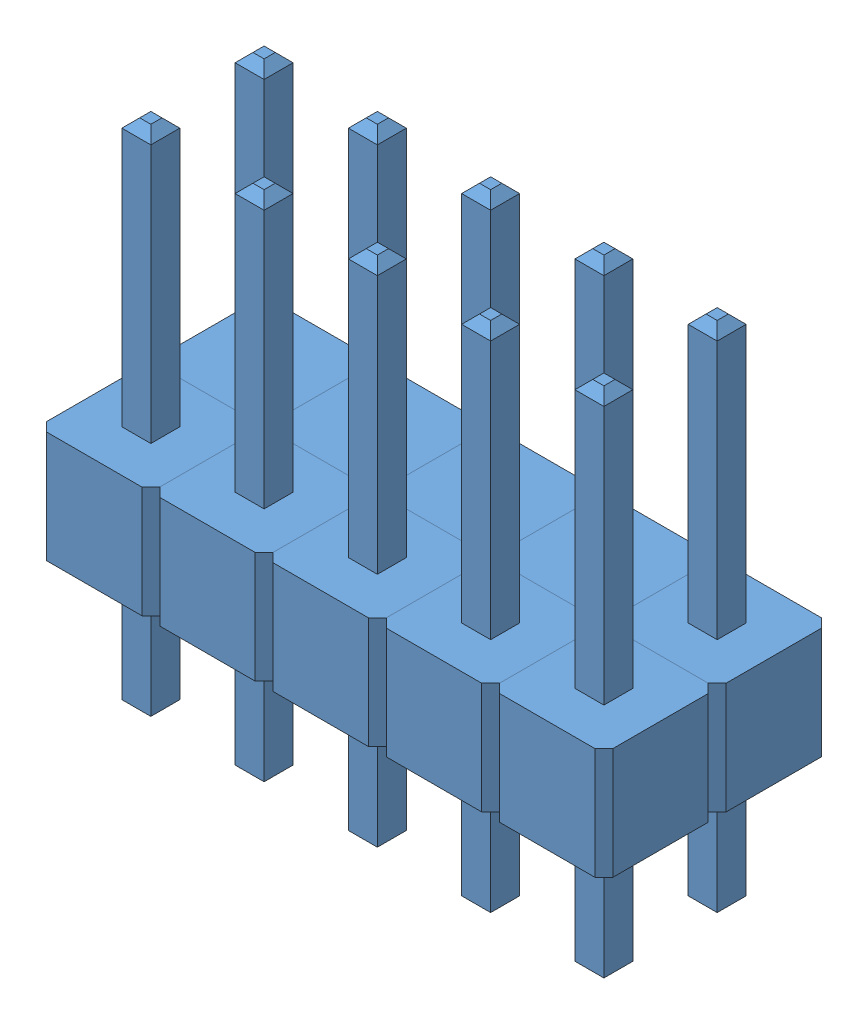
SolidWorks assembly Header10.SLDASM, configuration Default (file format 9000). Lengths in mm.
Overall size (12.7 11.5 5.08).
12 component instances, 1 part files, 3 mates.
Components (placement in the parent):
- Header5-1: Header5.SLDASM [Default] at (0.4446 1.0366 0.6441) size (12.7 11.5 2.54)
  - Header-1: Header.SLDPRT [Default] at (1.8213 3.3514 10.0633) size (2.54 11.5 2.54)
  - Header-2: Header.SLDPRT [Default] at (4.3613 3.3514 10.0633) size (2.54 11.5 2.54)
  - Header-3: Header.SLDPRT [Default] at (6.9013 3.3514 10.0633) size (2.54 11.5 2.54)
  - Header-4: Header.SLDPRT [Default] at (-0.7187 3.3514 10.0633) size (2.54 11.5 2.54)
  - Header-5: Header.SLDPRT [Default] at (-3.2587 3.3514 10.0633) size (2.54 11.5 2.54)
- Header5-2: Header5.SLDASM [Default] at (0.4446 1.0366 3.1841) size (12.7 11.5 2.54)
  - Header-1: Header.SLDPRT [Default] at (1.8213 3.3514 10.0633) size (2.54 11.5 2.54)
  - Header-2: Header.SLDPRT [Default] at (4.3613 3.3514 10.0633) size (2.54 11.5 2.54)
  - Header-3: Header.SLDPRT [Default] at (6.9013 3.3514 10.0633) size (2.54 11.5 2.54)
  - Header-4: Header.SLDPRT [Default] at (-0.7187 3.3514 10.0633) size (2.54 11.5 2.54)
  - Header-5: Header.SLDPRT [Default] at (-3.2587 3.3514 10.0633) size (2.54 11.5 2.54)
Mates (geometry in assembly coordinates):
- Coincident1: coincident: plane of Header5-1/Header-3 through (8.616 6.8879 11.9774) normal (1 0 0); plane of Header5-2/Header-3 through (8.616 6.8879 14.5174) normal (1 0 0)
- Coincident2: coincident: plane of Header5-1/Header-3 through (6.076 6.8879 11.9774) normal (0 0 1); plane of Header5-2/Header-3 through (6.076 6.8879 11.9774) normal (0 0 -1)
- Coincident3: coincident aligned: plane of Header5-1/Header-3 through (7.346 6.8879 10.7074) normal (0 1 0); plane of Header5-2/Header-3 through (7.346 6.8879 13.2474) normal (0 1 0)
